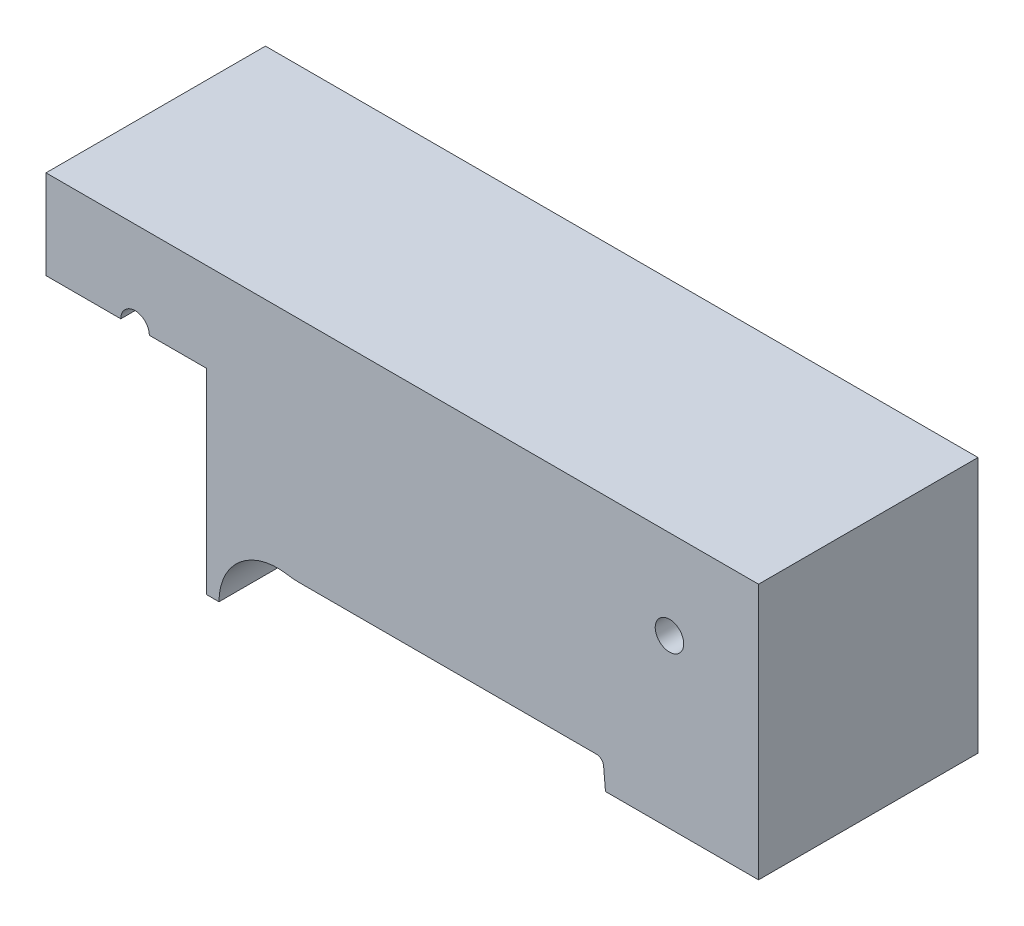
ISO-10303-21;
HEADER;
FILE_DESCRIPTION(('STEP AP214'),'2;1');
FILE_NAME('part.step','',(''),(''),'','','');
FILE_SCHEMA(('AUTOMOTIVE_DESIGN { 1 0 10303 214 1 1 1 1 }'));
ENDSEC;
DATA;
#1=APPLICATION_CONTEXT('core data for automotive mechanical design processes');
#2=APPLICATION_PROTOCOL_DEFINITION('international standard','automotive_design',2000,#1);
#3=PRODUCT_CONTEXT('',#1,'mechanical');
#4=PRODUCT('Part','Part','',(#3));
#5=PRODUCT_RELATED_PRODUCT_CATEGORY('part','',(#4));
#6=PRODUCT_DEFINITION_FORMATION('','',#4);
#7=PRODUCT_DEFINITION_CONTEXT('part definition',#1,'design');
#8=PRODUCT_DEFINITION('design','',#6,#7);
#9=PRODUCT_DEFINITION_SHAPE('','',#8);
#10=(LENGTH_UNIT() NAMED_UNIT(*) SI_UNIT(.MILLI.,.METRE.));
#11=(NAMED_UNIT(*) PLANE_ANGLE_UNIT() SI_UNIT($,.RADIAN.));
#12=(NAMED_UNIT(*) SI_UNIT($,.STERADIAN.) SOLID_ANGLE_UNIT());
#13=UNCERTAINTY_MEASURE_WITH_UNIT(LENGTH_MEASURE(1.E-05),#10,'distance_accuracy_value','');
#14=(GEOMETRIC_REPRESENTATION_CONTEXT(3) GLOBAL_UNCERTAINTY_ASSIGNED_CONTEXT((#13)) GLOBAL_UNIT_ASSIGNED_CONTEXT((#10,
#11,#12)) REPRESENTATION_CONTEXT('',''));
#15=CARTESIAN_POINT('',(0.,0.,0.));
#16=DIRECTION('',(0.,0.,1.));
#17=DIRECTION('',(1.,0.,0.));
#18=AXIS2_PLACEMENT_3D('',#15,#16,#17);
#19=CARTESIAN_POINT('',(0.,0.,65.));
#20=DIRECTION('',(1.,0.,0.));
#21=DIRECTION('',(0.,0.,-1.));
#22=AXIS2_PLACEMENT_3D('',#19,#20,#21);
#23=PLANE('',#22);
#24=DIRECTION('',(0.,1.,0.));
#25=VECTOR('',#24,1.);
#26=CARTESIAN_POINT('',(0.,0.,3.4));
#27=LINE('',#26,#25);
#28=CARTESIAN_POINT('',(0.,125.,3.4));
#29=VERTEX_POINT('',#28);
#30=CARTESIAN_POINT('',(0.,150.,3.4));
#31=VERTEX_POINT('',#30);
#32=EDGE_CURVE('E299',#29,#31,#27,.T.);
#33=ORIENTED_EDGE('',*,*,#32,.F.);
#34=DIRECTION('',(0.,0.,1.));
#35=VECTOR('',#34,1.);
#36=CARTESIAN_POINT('',(0.,125.,65.));
#37=LINE('',#36,#35);
#38=CARTESIAN_POINT('',(0.,125.,65.));
#39=VERTEX_POINT('',#38);
#40=EDGE_CURVE('E229',#29,#39,#37,.T.);
#41=ORIENTED_EDGE('',*,*,#40,.T.);
#42=DIRECTION('',(0.,-1.,0.));
#43=VECTOR('',#42,1.);
#44=CARTESIAN_POINT('',(0.,0.,65.));
#45=LINE('',#44,#43);
#46=CARTESIAN_POINT('',(0.,150.,65.));
#47=VERTEX_POINT('',#46);
#48=EDGE_CURVE('E333',#47,#39,#45,.T.);
#49=ORIENTED_EDGE('',*,*,#48,.F.);
#50=DIRECTION('',(0.,0.,-1.));
#51=VECTOR('',#50,1.);
#52=CARTESIAN_POINT('',(0.,150.,65.));
#53=LINE('',#52,#51);
#54=EDGE_CURVE('E348',#47,#31,#53,.T.);
#55=ORIENTED_EDGE('',*,*,#54,.T.);
#56=EDGE_LOOP('',(#33,#41,#49,#55));
#57=FACE_BOUND('',#56,.T.);
#58=ADVANCED_FACE('F30',(#57),#23,.F.);
#59=CARTESIAN_POINT('',(200.,0.,65.));
#60=DIRECTION('',(-1.,0.,0.));
#61=DIRECTION('',(0.,0.,1.));
#62=AXIS2_PLACEMENT_3D('',#59,#60,#61);
#63=PLANE('',#62);
#64=DIRECTION('',(0.,1.,0.));
#65=VECTOR('',#64,1.);
#66=CARTESIAN_POINT('',(200.,0.,65.));
#67=LINE('',#66,#65);
#68=CARTESIAN_POINT('',(200.,78.12,65.));
#69=VERTEX_POINT('',#68);
#70=CARTESIAN_POINT('',(200.,150.,65.));
#71=VERTEX_POINT('',#70);
#72=EDGE_CURVE('E344',#69,#71,#67,.T.);
#73=ORIENTED_EDGE('',*,*,#72,.F.);
#74=DIRECTION('',(0.,0.,-1.));
#75=VECTOR('',#74,1.);
#76=CARTESIAN_POINT('',(200.,78.12,65.));
#77=LINE('',#76,#75);
#78=CARTESIAN_POINT('',(200.,78.12,3.4));
#79=VERTEX_POINT('',#78);
#80=EDGE_CURVE('E240',#69,#79,#77,.T.);
#81=ORIENTED_EDGE('',*,*,#80,.T.);
#82=DIRECTION('',(0.,-1.,0.));
#83=VECTOR('',#82,1.);
#84=CARTESIAN_POINT('',(200.,0.,3.4));
#85=LINE('',#84,#83);
#86=CARTESIAN_POINT('',(200.,150.,3.4));
#87=VERTEX_POINT('',#86);
#88=EDGE_CURVE('E287',#87,#79,#85,.T.);
#89=ORIENTED_EDGE('',*,*,#88,.F.);
#90=DIRECTION('',(0.,0.,-1.));
#91=VECTOR('',#90,1.);
#92=CARTESIAN_POINT('',(200.,150.,65.));
#93=LINE('',#92,#91);
#94=EDGE_CURVE('E351',#71,#87,#93,.T.);
#95=ORIENTED_EDGE('',*,*,#94,.F.);
#96=EDGE_LOOP('',(#73,#81,#89,#95));
#97=FACE_BOUND('',#96,.T.);
#98=ADVANCED_FACE('F428',(#97),#63,.F.);
#99=CARTESIAN_POINT('',(0.,150.,65.));
#100=DIRECTION('',(0.,-1.,0.));
#101=DIRECTION('',(0.,0.,-1.));
#102=AXIS2_PLACEMENT_3D('',#99,#100,#101);
#103=PLANE('',#102);
#104=DIRECTION('',(1.,0.,0.));
#105=VECTOR('',#104,1.);
#106=CARTESIAN_POINT('',(0.,150.,3.4));
#107=LINE('',#106,#105);
#108=EDGE_CURVE('E354',#31,#87,#107,.T.);
#109=ORIENTED_EDGE('',*,*,#108,.F.);
#110=ORIENTED_EDGE('',*,*,#54,.F.);
#111=DIRECTION('',(-1.,0.,0.));
#112=VECTOR('',#111,1.);
#113=CARTESIAN_POINT('',(0.,150.,65.));
#114=LINE('',#113,#112);
#115=EDGE_CURVE('E346',#71,#47,#114,.T.);
#116=ORIENTED_EDGE('',*,*,#115,.F.);
#117=ORIENTED_EDGE('',*,*,#94,.T.);
#118=EDGE_LOOP('',(#109,#110,#116,#117));
#119=FACE_BOUND('',#118,.T.);
#120=ADVANCED_FACE('F433',(#119),#103,.F.);
#121=CARTESIAN_POINT('',(0.,150.,0.));
#122=DIRECTION('',(0.,0.,-1.));
#123=DIRECTION('',(-1.,0.,0.));
#124=AXIS2_PLACEMENT_3D('',#121,#122,#123);
#125=PLANE('',#124);
#126=DIRECTION('',(0.,-1.,0.));
#127=VECTOR('',#126,1.);
#128=CARTESIAN_POINT('',(45.,150.,0.));
#129=LINE('',#128,#127);
#130=CARTESIAN_POINT('',(45.,74.2424079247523,0.));
#131=VERTEX_POINT('',#130);
#132=CARTESIAN_POINT('',(45.,70.,0.));
#133=VERTEX_POINT('',#132);
#134=EDGE_CURVE('E236',#131,#133,#129,.T.);
#135=ORIENTED_EDGE('',*,*,#134,.F.);
#136=CARTESIAN_POINT('',(65.,70.,0.));
#137=DIRECTION('',(0.,0.,-1.));
#138=DIRECTION('',(-1.,0.,0.));
#139=AXIS2_PLACEMENT_3D('',#136,#137,#138);
#140=CIRCLE('',#139,20.445);
#141=CARTESIAN_POINT('',(68.4069528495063,90.1591343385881,0.));
#142=VERTEX_POINT('',#141);
#143=EDGE_CURVE('E273',#131,#142,#140,.T.);
#144=ORIENTED_EDGE('',*,*,#143,.T.);
#145=CARTESIAN_POINT('',(71.0781905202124,105.965,0.));
#146=DIRECTION('',(0.,0.,1.));
#147=DIRECTION('',(-1.,0.,0.));
#148=AXIS2_PLACEMENT_3D('',#145,#146,#147);
#149=CIRCLE('',#148,16.03);
#150=CARTESIAN_POINT('',(71.0781905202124,89.935,0.));
#151=VERTEX_POINT('',#150);
#152=EDGE_CURVE('E275',#142,#151,#149,.T.);
#153=ORIENTED_EDGE('',*,*,#152,.T.);
#154=DIRECTION('',(1.,0.,0.));
#155=VECTOR('',#154,1.);
#156=CARTESIAN_POINT('',(71.0781905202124,89.935,0.));
#157=LINE('',#156,#155);
#158=CARTESIAN_POINT('',(154.489847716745,89.935,0.));
#159=VERTEX_POINT('',#158);
#160=EDGE_CURVE('E278',#151,#159,#157,.T.);
#161=ORIENTED_EDGE('',*,*,#160,.T.);
#162=CARTESIAN_POINT('',(154.489847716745,83.905,0.));
#163=DIRECTION('',(0.,0.,-1.));
#164=DIRECTION('',(-1.,0.,0.));
#165=AXIS2_PLACEMENT_3D('',#162,#163,#164);
#166=CIRCLE('',#165,6.03);
#167=CARTESIAN_POINT('',(160.496901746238,84.4305491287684,0.));
#168=VERTEX_POINT('',#167);
#169=EDGE_CURVE('E281',#159,#168,#166,.T.);
#170=ORIENTED_EDGE('',*,*,#169,.T.);
#171=DIRECTION('',(0.0871557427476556,-0.996194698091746,0.));
#172=VECTOR('',#171,1.);
#173=CARTESIAN_POINT('',(160.496901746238,84.4305491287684,0.));
#174=LINE('',#173,#172);
#175=CARTESIAN_POINT('',(161.049003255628,78.12,0.));
#176=VERTEX_POINT('',#175);
#177=EDGE_CURVE('E270',#168,#176,#174,.T.);
#178=ORIENTED_EDGE('',*,*,#177,.T.);
#179=DIRECTION('',(1.,0.,0.));
#180=VECTOR('',#179,1.);
#181=CARTESIAN_POINT('',(0.,78.12,0.));
#182=LINE('',#181,#180);
#183=CARTESIAN_POINT('',(157.033723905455,78.12,0.));
#184=VERTEX_POINT('',#183);
#185=EDGE_CURVE('E243',#184,#176,#182,.T.);
#186=ORIENTED_EDGE('',*,*,#185,.F.);
#187=DIRECTION('',(-0.0871557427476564,0.996194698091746,0.));
#188=VECTOR('',#187,1.);
#189=CARTESIAN_POINT('',(156.512122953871,84.0819261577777,0.));
#190=LINE('',#189,#188);
#191=CARTESIAN_POINT('',(156.512122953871,84.0819261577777,0.));
#192=VERTEX_POINT('',#191);
#193=EDGE_CURVE('E321',#184,#192,#190,.T.);
#194=ORIENTED_EDGE('',*,*,#193,.T.);
#195=CARTESIAN_POINT('',(154.489847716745,83.905,0.));
#196=DIRECTION('',(0.,0.,1.));
#197=DIRECTION('',(-1.,0.,0.));
#198=AXIS2_PLACEMENT_3D('',#195,#196,#197);
#199=CIRCLE('',#198,2.03);
#200=CARTESIAN_POINT('',(154.489847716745,85.935,0.));
#201=VERTEX_POINT('',#200);
#202=EDGE_CURVE('E324',#192,#201,#199,.T.);
#203=ORIENTED_EDGE('',*,*,#202,.T.);
#204=DIRECTION('',(-1.,0.,0.));
#205=VECTOR('',#204,1.);
#206=CARTESIAN_POINT('',(71.0781905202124,85.935,0.));
#207=LINE('',#206,#205);
#208=CARTESIAN_POINT('',(71.0781905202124,85.935,0.));
#209=VERTEX_POINT('',#208);
#210=EDGE_CURVE('E327',#201,#209,#207,.T.);
#211=ORIENTED_EDGE('',*,*,#210,.T.);
#212=CARTESIAN_POINT('',(71.0781905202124,105.965,0.));
#213=DIRECTION('',(0.,0.,-1.));
#214=DIRECTION('',(-1.,0.,0.));
#215=AXIS2_PLACEMENT_3D('',#212,#213,#214);
#216=CIRCLE('',#215,20.03);
#217=CARTESIAN_POINT('',(67.7403932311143,86.2150630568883,0.));
#218=VERTEX_POINT('',#217);
#219=EDGE_CURVE('E315',#209,#218,#216,.T.);
#220=ORIENTED_EDGE('',*,*,#219,.T.);
#221=CARTESIAN_POINT('',(65.,70.,0.));
#222=DIRECTION('',(0.,0.,1.));
#223=DIRECTION('',(1.,0.,0.));
#224=AXIS2_PLACEMENT_3D('',#221,#222,#223);
#225=CIRCLE('',#224,16.445);
#226=CARTESIAN_POINT('',(48.555,70.,0.));
#227=VERTEX_POINT('',#226);
#228=EDGE_CURVE('E318',#218,#227,#225,.T.);
#229=ORIENTED_EDGE('',*,*,#228,.T.);
#230=DIRECTION('',(1.,0.,0.));
#231=VECTOR('',#230,1.);
#232=CARTESIAN_POINT('',(0.,70.,0.));
#233=LINE('',#232,#231);
#234=EDGE_CURVE('E245',#133,#227,#233,.T.);
#235=ORIENTED_EDGE('',*,*,#234,.F.);
#236=EDGE_LOOP('',(#135,#144,#153,#161,#170,#178,#186,#194,#203,#211,#220,#229,#235));
#237=FACE_BOUND('',#236,.T.);
#238=ADVANCED_FACE('F474',(#237),#125,.T.);
#239=CARTESIAN_POINT('',(0.,150.,65.));
#240=DIRECTION('',(0.,0.,-1.));
#241=DIRECTION('',(-1.,0.,0.));
#242=AXIS2_PLACEMENT_3D('',#239,#240,#241);
#243=PLANE('',#242);
#244=ORIENTED_EDGE('',*,*,#48,.T.);
#245=DIRECTION('',(1.,0.,0.));
#246=VECTOR('',#245,1.);
#247=CARTESIAN_POINT('',(-8.28625235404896,125.,65.));
#248=LINE('',#247,#246);
#249=CARTESIAN_POINT('',(21.,125.,65.));
#250=VERTEX_POINT('',#249);
#251=EDGE_CURVE('E216',#39,#250,#248,.T.);
#252=ORIENTED_EDGE('',*,*,#251,.T.);
#253=CARTESIAN_POINT('',(25.,125.,65.));
#254=DIRECTION('',(0.,0.,1.));
#255=DIRECTION('',(1.,0.,0.));
#256=AXIS2_PLACEMENT_3D('',#253,#254,#255);
#257=CIRCLE('',#256,3.99999999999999);
#258=CARTESIAN_POINT('',(29.,125.,65.));
#259=VERTEX_POINT('',#258);
#260=EDGE_CURVE('E215',#259,#250,#257,.T.);
#261=ORIENTED_EDGE('',*,*,#260,.F.);
#262=CARTESIAN_POINT('',(45.,125.,65.));
#263=VERTEX_POINT('',#262);
#264=EDGE_CURVE('E202',#259,#263,#248,.T.);
#265=ORIENTED_EDGE('',*,*,#264,.T.);
#266=DIRECTION('',(0.,-1.,0.));
#267=VECTOR('',#266,1.);
#268=CARTESIAN_POINT('',(45.,125.,65.));
#269=LINE('',#268,#267);
#270=CARTESIAN_POINT('',(45.,70.,65.));
#271=VERTEX_POINT('',#270);
#272=EDGE_CURVE('E192',#263,#271,#269,.T.);
#273=ORIENTED_EDGE('',*,*,#272,.T.);
#274=DIRECTION('',(1.,0.,0.));
#275=VECTOR('',#274,1.);
#276=CARTESIAN_POINT('',(45.,70.,65.));
#277=LINE('',#276,#275);
#278=CARTESIAN_POINT('',(48.555,70.,65.));
#279=VERTEX_POINT('',#278);
#280=EDGE_CURVE('E207',#271,#279,#277,.T.);
#281=ORIENTED_EDGE('',*,*,#280,.T.);
#282=CARTESIAN_POINT('',(65.,70.,65.));
#283=DIRECTION('',(0.,0.,1.));
#284=DIRECTION('',(1.,0.,0.));
#285=AXIS2_PLACEMENT_3D('',#282,#283,#284);
#286=CIRCLE('',#285,16.445);
#287=CARTESIAN_POINT('',(67.7403932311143,86.2150630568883,65.));
#288=VERTEX_POINT('',#287);
#289=EDGE_CURVE('E303',#288,#279,#286,.T.);
#290=ORIENTED_EDGE('',*,*,#289,.F.);
#291=CARTESIAN_POINT('',(71.0781905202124,105.965,65.));
#292=DIRECTION('',(0.,0.,-1.));
#293=DIRECTION('',(-1.,0.,0.));
#294=AXIS2_PLACEMENT_3D('',#291,#292,#293);
#295=CIRCLE('',#294,20.03);
#296=CARTESIAN_POINT('',(71.0781905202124,85.935,65.));
#297=VERTEX_POINT('',#296);
#298=EDGE_CURVE('E301',#297,#288,#295,.T.);
#299=ORIENTED_EDGE('',*,*,#298,.F.);
#300=DIRECTION('',(-1.,0.,0.));
#301=VECTOR('',#300,1.);
#302=CARTESIAN_POINT('',(71.0781905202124,85.935,65.));
#303=LINE('',#302,#301);
#304=CARTESIAN_POINT('',(154.489847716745,85.935,65.));
#305=VERTEX_POINT('',#304);
#306=EDGE_CURVE('E312',#305,#297,#303,.T.);
#307=ORIENTED_EDGE('',*,*,#306,.F.);
#308=CARTESIAN_POINT('',(154.489847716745,83.905,65.));
#309=DIRECTION('',(0.,0.,1.));
#310=DIRECTION('',(-1.,0.,0.));
#311=AXIS2_PLACEMENT_3D('',#308,#309,#310);
#312=CIRCLE('',#311,2.03);
#313=CARTESIAN_POINT('',(156.512122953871,84.0819261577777,65.));
#314=VERTEX_POINT('',#313);
#315=EDGE_CURVE('E309',#314,#305,#312,.T.);
#316=ORIENTED_EDGE('',*,*,#315,.F.);
#317=DIRECTION('',(-0.0871557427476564,0.996194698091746,0.));
#318=VECTOR('',#317,1.);
#319=CARTESIAN_POINT('',(156.512122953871,84.0819261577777,65.));
#320=LINE('',#319,#318);
#321=CARTESIAN_POINT('',(157.033723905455,78.12,65.));
#322=VERTEX_POINT('',#321);
#323=EDGE_CURVE('E306',#322,#314,#320,.T.);
#324=ORIENTED_EDGE('',*,*,#323,.F.);
#325=DIRECTION('',(1.,0.,0.));
#326=VECTOR('',#325,1.);
#327=CARTESIAN_POINT('',(82.4133961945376,78.12,65.));
#328=LINE('',#327,#326);
#329=EDGE_CURVE('E220',#322,#69,#328,.T.);
#330=ORIENTED_EDGE('',*,*,#329,.T.);
#331=ORIENTED_EDGE('',*,*,#72,.T.);
#332=ORIENTED_EDGE('',*,*,#115,.T.);
#333=EDGE_LOOP('',(#244,#252,#261,#265,#273,#281,#290,#299,#307,#316,#324,#330,#331,#332));
#334=FACE_BOUND('',#333,.T.);
#335=CARTESIAN_POINT('',(175.,125.,65.));
#336=DIRECTION('',(0.,0.,1.));
#337=DIRECTION('',(1.,0.,0.));
#338=AXIS2_PLACEMENT_3D('',#335,#336,#337);
#339=CIRCLE('',#338,3.99999999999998);
#340=CARTESIAN_POINT('',(179.,125.,65.));
#341=VERTEX_POINT('',#340);
#342=EDGE_CURVE('E254',#341,#341,#339,.T.);
#343=ORIENTED_EDGE('',*,*,#342,.F.);
#344=EDGE_LOOP('',(#343));
#345=FACE_BOUND('',#344,.T.);
#346=ADVANCED_FACE('F211',(#334,#345),#243,.F.);
#347=CARTESIAN_POINT('',(71.0781905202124,105.965,0.));
#348=DIRECTION('',(0.,0.,1.));
#349=DIRECTION('',(1.,0.,0.));
#350=AXIS2_PLACEMENT_3D('',#347,#348,#349);
#351=CYLINDRICAL_SURFACE('',#350,20.03);
#352=ORIENTED_EDGE('',*,*,#298,.T.);
#353=DIRECTION('',(0.,0.,1.));
#354=VECTOR('',#353,1.);
#355=CARTESIAN_POINT('',(67.7403932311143,86.2150630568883,0.));
#356=LINE('',#355,#354);
#357=EDGE_CURVE('E330',#218,#288,#356,.T.);
#358=ORIENTED_EDGE('',*,*,#357,.F.);
#359=ORIENTED_EDGE('',*,*,#219,.F.);
#360=DIRECTION('',(0.,0.,1.));
#361=VECTOR('',#360,1.);
#362=CARTESIAN_POINT('',(71.0781905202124,85.935,0.));
#363=LINE('',#362,#361);
#364=EDGE_CURVE('E331',#209,#297,#363,.T.);
#365=ORIENTED_EDGE('',*,*,#364,.T.);
#366=EDGE_LOOP('',(#352,#358,#359,#365));
#367=FACE_BOUND('',#366,.T.);
#368=ADVANCED_FACE('F491',(#367),#351,.T.);
#369=CARTESIAN_POINT('',(71.0781905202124,85.935,0.));
#370=DIRECTION('',(0.,1.,0.));
#371=DIRECTION('',(-1.,0.,0.));
#372=AXIS2_PLACEMENT_3D('',#369,#370,#371);
#373=PLANE('',#372);
#374=ORIENTED_EDGE('',*,*,#306,.T.);
#375=ORIENTED_EDGE('',*,*,#364,.F.);
#376=ORIENTED_EDGE('',*,*,#210,.F.);
#377=DIRECTION('',(0.,0.,1.));
#378=VECTOR('',#377,1.);
#379=CARTESIAN_POINT('',(154.489847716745,85.935,0.));
#380=LINE('',#379,#378);
#381=EDGE_CURVE('E334',#201,#305,#380,.T.);
#382=ORIENTED_EDGE('',*,*,#381,.T.);
#383=EDGE_LOOP('',(#374,#375,#376,#382));
#384=FACE_BOUND('',#383,.T.);
#385=ADVANCED_FACE('F494',(#384),#373,.F.);
#386=CARTESIAN_POINT('',(154.489847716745,83.905,0.));
#387=DIRECTION('',(0.,0.,1.));
#388=DIRECTION('',(1.,0.,0.));
#389=AXIS2_PLACEMENT_3D('',#386,#387,#388);
#390=CYLINDRICAL_SURFACE('',#389,2.03);
#391=ORIENTED_EDGE('',*,*,#315,.T.);
#392=ORIENTED_EDGE('',*,*,#381,.F.);
#393=ORIENTED_EDGE('',*,*,#202,.F.);
#394=DIRECTION('',(0.,0.,1.));
#395=VECTOR('',#394,1.);
#396=CARTESIAN_POINT('',(156.512122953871,84.0819261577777,0.));
#397=LINE('',#396,#395);
#398=EDGE_CURVE('E336',#192,#314,#397,.T.);
#399=ORIENTED_EDGE('',*,*,#398,.T.);
#400=EDGE_LOOP('',(#391,#392,#393,#399));
#401=FACE_BOUND('',#400,.T.);
#402=ADVANCED_FACE('F497',(#401),#390,.F.);
#403=CARTESIAN_POINT('',(156.512122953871,84.0819261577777,0.));
#404=DIRECTION('',(0.996194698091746,0.0871557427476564,0.));
#405=DIRECTION('',(-0.0871557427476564,0.996194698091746,0.));
#406=AXIS2_PLACEMENT_3D('',#403,#404,#405);
#407=PLANE('',#406);
#408=ORIENTED_EDGE('',*,*,#323,.T.);
#409=ORIENTED_EDGE('',*,*,#398,.F.);
#410=ORIENTED_EDGE('',*,*,#193,.F.);
#411=DIRECTION('',(0.,0.,1.));
#412=VECTOR('',#411,1.);
#413=CARTESIAN_POINT('',(157.033723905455,78.12,0.));
#414=LINE('',#413,#412);
#415=EDGE_CURVE('E338',#184,#322,#414,.T.);
#416=ORIENTED_EDGE('',*,*,#415,.T.);
#417=EDGE_LOOP('',(#408,#409,#410,#416));
#418=FACE_BOUND('',#417,.T.);
#419=ADVANCED_FACE('F500',(#418),#407,.F.);
#420=CARTESIAN_POINT('',(65.,70.,0.));
#421=DIRECTION('',(0.,0.,1.));
#422=DIRECTION('',(1.,0.,0.));
#423=AXIS2_PLACEMENT_3D('',#420,#421,#422);
#424=CYLINDRICAL_SURFACE('',#423,16.445);
#425=ORIENTED_EDGE('',*,*,#289,.T.);
#426=DIRECTION('',(0.,0.,1.));
#427=VECTOR('',#426,1.);
#428=CARTESIAN_POINT('',(48.555,70.,0.));
#429=LINE('',#428,#427);
#430=EDGE_CURVE('E11',#279,#227,#429,.F.);
#431=ORIENTED_EDGE('',*,*,#430,.T.);
#432=ORIENTED_EDGE('',*,*,#228,.F.);
#433=ORIENTED_EDGE('',*,*,#357,.T.);
#434=EDGE_LOOP('',(#425,#431,#432,#433));
#435=FACE_BOUND('',#434,.T.);
#436=ADVANCED_FACE('F485',(#435),#424,.F.);
#437=CARTESIAN_POINT('',(210.705320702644,-13.0537997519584,3.4));
#438=DIRECTION('',(0.,0.,-1.));
#439=DIRECTION('',(-1.,0.,0.));
#440=AXIS2_PLACEMENT_3D('',#437,#438,#439);
#441=PLANE('',#440);
#442=DIRECTION('',(1.,0.,0.));
#443=VECTOR('',#442,1.);
#444=CARTESIAN_POINT('',(210.705320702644,125.,3.4));
#445=LINE('',#444,#443);
#446=CARTESIAN_POINT('',(45.,125.,3.4));
#447=VERTEX_POINT('',#446);
#448=EDGE_CURVE('E206',#29,#447,#445,.T.);
#449=ORIENTED_EDGE('',*,*,#448,.F.);
#450=ORIENTED_EDGE('',*,*,#32,.T.);
#451=ORIENTED_EDGE('',*,*,#108,.T.);
#452=ORIENTED_EDGE('',*,*,#88,.T.);
#453=DIRECTION('',(1.,0.,0.));
#454=VECTOR('',#453,1.);
#455=CARTESIAN_POINT('',(210.705320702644,78.12,3.4));
#456=LINE('',#455,#454);
#457=CARTESIAN_POINT('',(164.060462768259,78.12,3.4));
#458=VERTEX_POINT('',#457);
#459=EDGE_CURVE('E238',#458,#79,#456,.T.);
#460=ORIENTED_EDGE('',*,*,#459,.F.);
#461=DIRECTION('',(0.0871557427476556,-0.996194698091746,0.));
#462=VECTOR('',#461,1.);
#463=CARTESIAN_POINT('',(163.485485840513,84.6920163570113,3.4));
#464=LINE('',#463,#462);
#465=CARTESIAN_POINT('',(163.485485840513,84.6920163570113,3.4));
#466=VERTEX_POINT('',#465);
#467=EDGE_CURVE('E359',#458,#466,#464,.F.);
#468=ORIENTED_EDGE('',*,*,#467,.T.);
#469=CARTESIAN_POINT('',(154.489847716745,83.905,3.4));
#470=DIRECTION('',(0.,0.,-1.));
#471=DIRECTION('',(-1.,0.,0.));
#472=AXIS2_PLACEMENT_3D('',#469,#470,#471);
#473=CIRCLE('',#472,9.03);
#474=CARTESIAN_POINT('',(154.489847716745,92.935,3.4));
#475=VERTEX_POINT('',#474);
#476=EDGE_CURVE('E361',#466,#475,#473,.F.);
#477=ORIENTED_EDGE('',*,*,#476,.T.);
#478=DIRECTION('',(1.,0.,0.));
#479=VECTOR('',#478,1.);
#480=CARTESIAN_POINT('',(71.0781905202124,92.935,3.4));
#481=LINE('',#480,#479);
#482=CARTESIAN_POINT('',(71.0781905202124,92.935,3.4));
#483=VERTEX_POINT('',#482);
#484=EDGE_CURVE('E363',#475,#483,#481,.F.);
#485=ORIENTED_EDGE('',*,*,#484,.T.);
#486=CARTESIAN_POINT('',(71.0781905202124,105.965,3.4));
#487=DIRECTION('',(0.,0.,-1.));
#488=DIRECTION('',(-1.,0.,0.));
#489=AXIS2_PLACEMENT_3D('',#486,#487,#488);
#490=CIRCLE('',#489,13.03);
#491=CARTESIAN_POINT('',(68.9068725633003,93.1171877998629,3.4));
#492=VERTEX_POINT('',#491);
#493=EDGE_CURVE('E368',#483,#492,#490,.T.);
#494=ORIENTED_EDGE('',*,*,#493,.T.);
#495=CARTESIAN_POINT('',(65.,70.,3.4));
#496=DIRECTION('',(0.,0.,-1.));
#497=DIRECTION('',(-1.,0.,0.));
#498=AXIS2_PLACEMENT_3D('',#495,#496,#497);
#499=CIRCLE('',#498,23.445);
#500=CARTESIAN_POINT('',(45.,82.2338883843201,3.4));
#501=VERTEX_POINT('',#500);
#502=EDGE_CURVE('E365',#492,#501,#499,.F.);
#503=ORIENTED_EDGE('',*,*,#502,.T.);
#504=DIRECTION('',(0.,-1.,0.));
#505=VECTOR('',#504,1.);
#506=CARTESIAN_POINT('',(45.,-13.0537997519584,3.4));
#507=LINE('',#506,#505);
#508=EDGE_CURVE('E234',#447,#501,#507,.T.);
#509=ORIENTED_EDGE('',*,*,#508,.F.);
#510=EDGE_LOOP('',(#449,#450,#451,#452,#460,#468,#477,#485,#494,#503,#509));
#511=FACE_BOUND('',#510,.T.);
#512=ADVANCED_FACE('F440',(#511),#441,.T.);
#513=CARTESIAN_POINT('',(160.496901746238,84.4305491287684,3.4));
#514=DIRECTION('',(0.996194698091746,0.0871557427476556,0.));
#515=DIRECTION('',(-0.0871557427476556,0.996194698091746,0.));
#516=AXIS2_PLACEMENT_3D('',#513,#514,#515);
#517=PLANE('',#516);
#518=DIRECTION('',(0.,0.,-1.));
#519=VECTOR('',#518,1.);
#520=CARTESIAN_POINT('',(160.496901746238,84.4305491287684,3.4));
#521=LINE('',#520,#519);
#522=CARTESIAN_POINT('',(160.496901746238,84.4305491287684,0.4));
#523=VERTEX_POINT('',#522);
#524=EDGE_CURVE('E285',#523,#168,#521,.T.);
#525=ORIENTED_EDGE('',*,*,#524,.F.);
#526=DIRECTION('',(0.0871557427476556,-0.996194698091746,0.));
#527=VECTOR('',#526,1.);
#528=CARTESIAN_POINT('',(161.049003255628,78.12,0.4));
#529=LINE('',#528,#527);
#530=CARTESIAN_POINT('',(161.049003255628,78.12,0.4));
#531=VERTEX_POINT('',#530);
#532=EDGE_CURVE('E376',#523,#531,#529,.T.);
#533=ORIENTED_EDGE('',*,*,#532,.T.);
#534=DIRECTION('',(0.,0.,-1.));
#535=VECTOR('',#534,1.);
#536=CARTESIAN_POINT('',(161.049003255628,78.12,3.4));
#537=LINE('',#536,#535);
#538=EDGE_CURVE('E284',#531,#176,#537,.T.);
#539=ORIENTED_EDGE('',*,*,#538,.T.);
#540=ORIENTED_EDGE('',*,*,#177,.F.);
#541=EDGE_LOOP('',(#525,#533,#539,#540));
#542=FACE_BOUND('',#541,.T.);
#543=ADVANCED_FACE('F506',(#542),#517,.T.);
#544=CARTESIAN_POINT('',(154.489847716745,83.905,3.4));
#545=DIRECTION('',(0.,0.,-1.));
#546=DIRECTION('',(-1.,0.,0.));
#547=AXIS2_PLACEMENT_3D('',#544,#545,#546);
#548=CYLINDRICAL_SURFACE('',#547,6.03);
#549=DIRECTION('',(0.,0.,-1.));
#550=VECTOR('',#549,1.);
#551=CARTESIAN_POINT('',(154.489847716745,89.935,3.4));
#552=LINE('',#551,#550);
#553=CARTESIAN_POINT('',(154.489847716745,89.935,0.4));
#554=VERTEX_POINT('',#553);
#555=EDGE_CURVE('E288',#554,#159,#552,.T.);
#556=ORIENTED_EDGE('',*,*,#555,.F.);
#557=CARTESIAN_POINT('',(154.489847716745,83.905,0.4));
#558=DIRECTION('',(0.,0.,-1.));
#559=DIRECTION('',(-1.,0.,0.));
#560=AXIS2_PLACEMENT_3D('',#557,#558,#559);
#561=CIRCLE('',#560,6.03);
#562=EDGE_CURVE('E52',#554,#523,#561,.T.);
#563=ORIENTED_EDGE('',*,*,#562,.T.);
#564=ORIENTED_EDGE('',*,*,#524,.T.);
#565=ORIENTED_EDGE('',*,*,#169,.F.);
#566=EDGE_LOOP('',(#556,#563,#564,#565));
#567=FACE_BOUND('',#566,.T.);
#568=ADVANCED_FACE('F507',(#567),#548,.T.);
#569=CARTESIAN_POINT('',(71.0781905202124,89.935,3.4));
#570=DIRECTION('',(0.,1.,0.));
#571=DIRECTION('',(-1.,0.,0.));
#572=AXIS2_PLACEMENT_3D('',#569,#570,#571);
#573=PLANE('',#572);
#574=DIRECTION('',(0.,0.,-1.));
#575=VECTOR('',#574,1.);
#576=CARTESIAN_POINT('',(71.0781905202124,89.935,3.4));
#577=LINE('',#576,#575);
#578=CARTESIAN_POINT('',(71.0781905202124,89.935,0.4));
#579=VERTEX_POINT('',#578);
#580=EDGE_CURVE('E290',#579,#151,#577,.T.);
#581=ORIENTED_EDGE('',*,*,#580,.F.);
#582=DIRECTION('',(1.,0.,0.));
#583=VECTOR('',#582,1.);
#584=CARTESIAN_POINT('',(154.489847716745,89.935,0.4));
#585=LINE('',#584,#583);
#586=EDGE_CURVE('E373',#579,#554,#585,.T.);
#587=ORIENTED_EDGE('',*,*,#586,.T.);
#588=ORIENTED_EDGE('',*,*,#555,.T.);
#589=ORIENTED_EDGE('',*,*,#160,.F.);
#590=EDGE_LOOP('',(#581,#587,#588,#589));
#591=FACE_BOUND('',#590,.T.);
#592=ADVANCED_FACE('F470',(#591),#573,.T.);
#593=CARTESIAN_POINT('',(71.0781905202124,105.965,3.4));
#594=DIRECTION('',(0.,0.,-1.));
#595=DIRECTION('',(-1.,0.,0.));
#596=AXIS2_PLACEMENT_3D('',#593,#594,#595);
#597=CYLINDRICAL_SURFACE('',#596,16.03);
#598=DIRECTION('',(0.,0.,-1.));
#599=VECTOR('',#598,1.);
#600=CARTESIAN_POINT('',(68.4069528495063,90.1591343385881,3.4));
#601=LINE('',#600,#599);
#602=CARTESIAN_POINT('',(68.4069528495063,90.1591343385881,0.4));
#603=VERTEX_POINT('',#602);
#604=EDGE_CURVE('E292',#603,#142,#601,.T.);
#605=ORIENTED_EDGE('',*,*,#604,.F.);
#606=CARTESIAN_POINT('',(71.0781905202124,105.965,0.4));
#607=DIRECTION('',(0.,0.,-1.));
#608=DIRECTION('',(-1.,0.,0.));
#609=AXIS2_PLACEMENT_3D('',#606,#607,#608);
#610=CIRCLE('',#609,16.03);
#611=EDGE_CURVE('E356',#603,#579,#610,.F.);
#612=ORIENTED_EDGE('',*,*,#611,.T.);
#613=ORIENTED_EDGE('',*,*,#580,.T.);
#614=ORIENTED_EDGE('',*,*,#152,.F.);
#615=EDGE_LOOP('',(#605,#612,#613,#614));
#616=FACE_BOUND('',#615,.T.);
#617=ADVANCED_FACE('F467',(#616),#597,.F.);
#618=CARTESIAN_POINT('',(65.,70.,3.4));
#619=DIRECTION('',(0.,0.,-1.));
#620=DIRECTION('',(-1.,0.,0.));
#621=AXIS2_PLACEMENT_3D('',#618,#619,#620);
#622=CYLINDRICAL_SURFACE('',#621,20.445);
#623=DIRECTION('',(0.,0.,-1.));
#624=VECTOR('',#623,1.);
#625=CARTESIAN_POINT('',(45.,74.2424079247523,3.4));
#626=LINE('',#625,#624);
#627=CARTESIAN_POINT('',(45.,74.2424079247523,0.400000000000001));
#628=VERTEX_POINT('',#627);
#629=EDGE_CURVE('E232',#628,#131,#626,.T.);
#630=ORIENTED_EDGE('',*,*,#629,.F.);
#631=CARTESIAN_POINT('',(65.,70.,0.4));
#632=DIRECTION('',(0.,0.,-1.));
#633=DIRECTION('',(-1.,0.,0.));
#634=AXIS2_PLACEMENT_3D('',#631,#632,#633);
#635=CIRCLE('',#634,20.445);
#636=EDGE_CURVE('E371',#628,#603,#635,.T.);
#637=ORIENTED_EDGE('',*,*,#636,.T.);
#638=ORIENTED_EDGE('',*,*,#604,.T.);
#639=ORIENTED_EDGE('',*,*,#143,.F.);
#640=EDGE_LOOP('',(#630,#637,#638,#639));
#641=FACE_BOUND('',#640,.T.);
#642=ADVANCED_FACE('F479',(#641),#622,.T.);
#643=CARTESIAN_POINT('',(163.485485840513,84.6920163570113,0.4));
#644=DIRECTION('',(-0.0871557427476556,0.996194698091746,0.));
#645=DIRECTION('',(-0.996194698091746,-0.0871557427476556,0.));
#646=AXIS2_PLACEMENT_3D('',#643,#644,#645);
#647=CYLINDRICAL_SURFACE('',#646,3.);
#648=CARTESIAN_POINT('',(164.060462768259,78.12,0.4));
#649=DIRECTION('',(0.,1.,0.));
#650=DIRECTION('',(-1.,0.,0.));
#651=AXIS2_PLACEMENT_3D('',#648,#649,#650);
#652=ELLIPSE('',#651,3.01145951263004,3.);
#653=EDGE_CURVE('E267',#458,#531,#652,.F.);
#654=ORIENTED_EDGE('',*,*,#653,.T.);
#655=ORIENTED_EDGE('',*,*,#532,.F.);
#656=CARTESIAN_POINT('',(163.485485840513,84.6920163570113,0.4));
#657=DIRECTION('',(0.0871557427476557,-0.996194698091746,0.));
#658=DIRECTION('',(0.996194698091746,0.0871557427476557,0.));
#659=AXIS2_PLACEMENT_3D('',#656,#657,#658);
#660=CIRCLE('',#659,3.);
#661=EDGE_CURVE('E264',#466,#523,#660,.T.);
#662=ORIENTED_EDGE('',*,*,#661,.F.);
#663=ORIENTED_EDGE('',*,*,#467,.F.);
#664=EDGE_LOOP('',(#654,#655,#662,#663));
#665=FACE_BOUND('',#664,.T.);
#666=ADVANCED_FACE('F451',(#665),#647,.F.);
#667=CARTESIAN_POINT('',(154.489847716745,83.905,0.4));
#668=DIRECTION('',(0.,0.,-1.));
#669=DIRECTION('',(-1.,0.,0.));
#670=AXIS2_PLACEMENT_3D('',#667,#668,#669);
#671=TOROIDAL_SURFACE('',#670,9.03,3.);
#672=ORIENTED_EDGE('',*,*,#661,.T.);
#673=ORIENTED_EDGE('',*,*,#562,.F.);
#674=CARTESIAN_POINT('',(154.489847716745,92.935,0.4));
#675=DIRECTION('',(1.,0.,0.));
#676=DIRECTION('',(0.,0.,-1.));
#677=AXIS2_PLACEMENT_3D('',#674,#675,#676);
#678=CIRCLE('',#677,3.);
#679=EDGE_CURVE('E261',#475,#554,#678,.T.);
#680=ORIENTED_EDGE('',*,*,#679,.F.);
#681=ORIENTED_EDGE('',*,*,#476,.F.);
#682=EDGE_LOOP('',(#672,#673,#680,#681));
#683=FACE_BOUND('',#682,.T.);
#684=ADVANCED_FACE('F425',(#683),#671,.F.);
#685=CARTESIAN_POINT('',(65.,70.,0.4));
#686=DIRECTION('',(0.,0.,-1.));
#687=DIRECTION('',(-1.,0.,0.));
#688=AXIS2_PLACEMENT_3D('',#685,#686,#687);
#689=TOROIDAL_SURFACE('',#688,23.445,3.);
#690=ORIENTED_EDGE('',*,*,#636,.F.);
#691=CARTESIAN_POINT('',(45.,74.2424119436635,0.397763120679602));
#692=CARTESIAN_POINT('',(45.,74.2422846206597,0.436382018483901));
#693=CARTESIAN_POINT('',(45.,74.2457837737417,0.475064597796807));
#694=CARTESIAN_POINT('',(45.,74.2595823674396,0.551236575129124));
#695=CARTESIAN_POINT('',(45.,74.2699016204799,0.588722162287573));
#696=CARTESIAN_POINT('',(45.,74.3006091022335,0.67414926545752));
#697=CARTESIAN_POINT('',(45.,74.323235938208,0.721272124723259));
#698=CARTESIAN_POINT('',(45.,74.3754293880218,0.811456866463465));
#699=CARTESIAN_POINT('',(45.,74.4050124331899,0.854508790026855));
#700=CARTESIAN_POINT('',(45.,74.4752516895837,0.945304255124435));
#701=CARTESIAN_POINT('',(45.,74.5169374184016,0.99223657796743));
#702=CARTESIAN_POINT('',(45.,74.6046187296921,1.08193936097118));
#703=CARTESIAN_POINT('',(45.,74.6506221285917,1.12470197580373));
#704=CARTESIAN_POINT('',(45.,74.7457595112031,1.20710476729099));
#705=CARTESIAN_POINT('',(45.,74.7949093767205,1.24672640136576));
#706=CARTESIAN_POINT('',(45.,74.8952181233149,1.32321714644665));
#707=CARTESIAN_POINT('',(45.,74.9463752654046,1.36008856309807));
#708=CARTESIAN_POINT('',(45.,75.0912359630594,1.45991072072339));
#709=CARTESIAN_POINT('',(45.,75.1866054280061,1.52043705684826));
#710=CARTESIAN_POINT('',(45.,75.3804487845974,1.63633549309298));
#711=CARTESIAN_POINT('',(45.,75.4789245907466,1.69170432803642));
#712=CARTESIAN_POINT('',(45.,75.6782482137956,1.79847034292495));
#713=CARTESIAN_POINT('',(45.,75.7791003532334,1.84985941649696));
#714=CARTESIAN_POINT('',(45.,75.9824630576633,1.94925655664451));
#715=CARTESIAN_POINT('',(45.,76.0849738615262,1.99726413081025));
#716=CARTESIAN_POINT('',(45.,76.3951042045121,2.13723135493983));
#717=CARTESIAN_POINT('',(45.,76.6047042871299,2.22481399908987));
#718=CARTESIAN_POINT('',(45.,77.0273683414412,2.39028368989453));
#719=CARTESIAN_POINT('',(45.,77.2404279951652,2.46818190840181));
#720=CARTESIAN_POINT('',(45.,77.6706159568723,2.61556277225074));
#721=CARTESIAN_POINT('',(45.,77.8877591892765,2.68500182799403));
#722=CARTESIAN_POINT('',(45.,78.3246535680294,2.81521115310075));
#723=CARTESIAN_POINT('',(45.,78.5444050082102,2.87598043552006));
#724=CARTESIAN_POINT('',(45.,78.9864944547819,2.98870336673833));
#725=CARTESIAN_POINT('',(45.,79.2088356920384,3.04064437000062));
#726=CARTESIAN_POINT('',(45.,79.6555105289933,3.13509319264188));
#727=CARTESIAN_POINT('',(45.,79.8798440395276,3.1776014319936));
#728=CARTESIAN_POINT('',(45.,80.3291117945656,3.25224700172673));
#729=CARTESIAN_POINT('',(45.,80.554037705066,3.28443414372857));
#730=CARTESIAN_POINT('',(45.,81.0052163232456,3.33774328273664));
#731=CARTESIAN_POINT('',(45.,81.2314690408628,3.35886519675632));
#732=CARTESIAN_POINT('',(45.,81.6843765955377,3.38879240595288));
#733=CARTESIAN_POINT('',(45.,81.9110298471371,3.3976210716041));
#734=CARTESIAN_POINT('',(45.,82.3645054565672,3.40154509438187));
#735=CARTESIAN_POINT('',(45.,82.5913278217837,3.39663981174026));
#736=CARTESIAN_POINT('',(45.,83.0165245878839,3.37281337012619));
#737=CARTESIAN_POINT('',(45.,83.2149962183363,3.35567368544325));
#738=CARTESIAN_POINT('',(45.,83.610258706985,3.3079081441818));
#739=CARTESIAN_POINT('',(45.,83.8070503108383,3.27728862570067));
#740=CARTESIAN_POINT('',(45.,84.1971403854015,3.20089155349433));
#741=CARTESIAN_POINT('',(45.,84.3904472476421,3.15515767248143));
#742=CARTESIAN_POINT('',(45.,84.7720630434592,3.04643883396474));
#743=CARTESIAN_POINT('',(45.,84.9603760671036,2.98346850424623));
#744=CARTESIAN_POINT('',(45.,85.330748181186,2.83722499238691));
#745=CARTESIAN_POINT('',(45.,85.5127483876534,2.75380013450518));
#746=CARTESIAN_POINT('',(45.,85.8646103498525,2.56399460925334));
#747=CARTESIAN_POINT('',(45.,86.0344757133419,2.45762080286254));
#748=CARTESIAN_POINT('',(45.,86.3290082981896,2.23867895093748));
#749=CARTESIAN_POINT('',(45.,86.4565213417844,2.12997985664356));
#750=CARTESIAN_POINT('',(45.,86.6925267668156,1.89350564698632));
#751=CARTESIAN_POINT('',(45.,86.801052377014,1.76576459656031));
#752=CARTESIAN_POINT('',(45.,86.9677799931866,1.52612240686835));
#753=CARTESIAN_POINT('',(45.,87.0317778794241,1.4182712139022));
#754=CARTESIAN_POINT('',(45.,87.1413551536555,1.1935199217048));
#755=CARTESIAN_POINT('',(45.,87.1869472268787,1.07662612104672));
#756=CARTESIAN_POINT('',(45.,87.2566751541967,0.83559522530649));
#757=CARTESIAN_POINT('',(45.,87.2806557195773,0.711412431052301));
#758=CARTESIAN_POINT('',(45.,87.304458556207,0.460751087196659));
#759=CARTESIAN_POINT('',(45.,87.3042920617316,0.334273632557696));
#760=CARTESIAN_POINT('',(45.,87.2812182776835,0.0975084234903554));
#761=CARTESIAN_POINT('',(45.,87.2608064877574,-0.0130338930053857));
#762=CARTESIAN_POINT('',(45.,87.2023566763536,-0.229315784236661));
#763=CARTESIAN_POINT('',(45.,87.1643158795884,-0.33505459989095));
#764=CARTESIAN_POINT('',(45.,87.0711589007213,-0.543477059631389));
#765=CARTESIAN_POINT('',(45.,87.0154499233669,-0.645892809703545));
#766=CARTESIAN_POINT('',(45.,86.8903947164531,-0.841954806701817));
#767=CARTESIAN_POINT('',(45.,86.8210419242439,-0.935596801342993));
#768=CARTESIAN_POINT('',(45.,86.6273054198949,-1.16608782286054));
#769=CARTESIAN_POINT('',(45.,86.4945612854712,-1.2959174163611));
#770=CARTESIAN_POINT('',(45.,86.2101640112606,-1.53301630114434));
#771=CARTESIAN_POINT('',(45.,86.058459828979,-1.64022251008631));
#772=CARTESIAN_POINT('',(45.,85.7791457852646,-1.81146525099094));
#773=CARTESIAN_POINT('',(45.,85.654083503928,-1.87975080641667));
#774=CARTESIAN_POINT('',(45.,85.3984416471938,-2.00518533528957));
#775=CARTESIAN_POINT('',(45.,85.2678590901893,-2.06232819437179));
#776=CARTESIAN_POINT('',(45.,85.0026444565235,-2.16648713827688));
#777=CARTESIAN_POINT('',(45.,84.8680094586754,-2.21349570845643));
#778=CARTESIAN_POINT('',(45.,84.5958458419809,-2.29828183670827));
#779=CARTESIAN_POINT('',(45.,84.4583162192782,-2.33605613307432));
#780=CARTESIAN_POINT('',(45.,84.085309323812,-2.42645267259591));
#781=CARTESIAN_POINT('',(45.,83.8479236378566,-2.47125552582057));
#782=CARTESIAN_POINT('',(45.,83.37015237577,-2.54026398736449));
#783=CARTESIAN_POINT('',(45.,83.1297647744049,-2.564454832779));
#784=CARTESIAN_POINT('',(45.,82.6471733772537,-2.59501205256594));
#785=CARTESIAN_POINT('',(45.,82.4049662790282,-2.6013238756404));
#786=CARTESIAN_POINT('',(45.,81.9207528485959,-2.59822013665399));
#787=CARTESIAN_POINT('',(45.,81.6787464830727,-2.58880818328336));
#788=CARTESIAN_POINT('',(45.,81.2245819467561,-2.55803575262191));
#789=CARTESIAN_POINT('',(45.,81.0123133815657,-2.53823780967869));
#790=CARTESIAN_POINT('',(45.,80.5888926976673,-2.48886403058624));
#791=CARTESIAN_POINT('',(45.,80.3777407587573,-2.45928666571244));
#792=CARTESIAN_POINT('',(45.,79.9566787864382,-2.39114046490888));
#793=CARTESIAN_POINT('',(45.,79.7467702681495,-2.3525623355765));
#794=CARTESIAN_POINT('',(45.,79.3286766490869,-2.26707606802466));
#795=CARTESIAN_POINT('',(45.,79.1204914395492,-2.22016845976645));
#796=CARTESIAN_POINT('',(45.,78.706362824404,-2.11855327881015));
#797=CARTESIAN_POINT('',(45.,78.5004165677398,-2.06385730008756));
#798=CARTESIAN_POINT('',(45.,78.0906964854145,-1.9468571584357));
#799=CARTESIAN_POINT('',(45.,77.8869226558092,-1.88455300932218));
#800=CARTESIAN_POINT('',(45.,77.4820729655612,-1.75236867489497));
#801=CARTESIAN_POINT('',(45.,77.2809946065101,-1.68249614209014));
#802=CARTESIAN_POINT('',(45.,76.8818406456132,-1.53470751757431));
#803=CARTESIAN_POINT('',(45.,76.6837643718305,-1.45679325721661));
#804=CARTESIAN_POINT('',(45.,76.4113166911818,-1.3421697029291));
#805=CARTESIAN_POINT('',(45.,76.3352940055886,-1.30936498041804));
#806=CARTESIAN_POINT('',(45.,76.1839284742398,-1.24223091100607));
#807=CARTESIAN_POINT('',(45.,76.1085856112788,-1.20790160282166));
#808=CARTESIAN_POINT('',(45.,75.8839765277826,-1.10254128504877));
#809=CARTESIAN_POINT('',(45.,75.7358536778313,-1.0290229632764));
#810=CARTESIAN_POINT('',(45.,75.489159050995,-0.897376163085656));
#811=CARTESIAN_POINT('',(45.,75.3893950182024,-0.841494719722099));
#812=CARTESIAN_POINT('',(45.,75.1927364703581,-0.724279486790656));
#813=CARTESIAN_POINT('',(45.,75.0958505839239,-0.662931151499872));
#814=CARTESIAN_POINT('',(45.,74.9023825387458,-0.529935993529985));
#815=CARTESIAN_POINT('',(45.,74.8060310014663,-0.457939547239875));
#816=CARTESIAN_POINT('',(45.,74.6691264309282,-0.34123537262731));
#817=CARTESIAN_POINT('',(45.,74.6248272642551,-0.300954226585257));
#818=CARTESIAN_POINT('',(45.,74.5399093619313,-0.216718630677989));
#819=CARTESIAN_POINT('',(45.,74.4992853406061,-0.172769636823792));
#820=CARTESIAN_POINT('',(45.,74.4309549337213,-0.0893144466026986));
#821=CARTESIAN_POINT('',(45.,74.4022750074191,-0.0506159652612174));
#822=CARTESIAN_POINT('',(45.,74.3500987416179,0.0301937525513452));
#823=CARTESIAN_POINT('',(45.,74.3265980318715,0.0723020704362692));
#824=CARTESIAN_POINT('',(45.,74.2907787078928,0.151635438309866));
#825=CARTESIAN_POINT('',(45.,74.2771852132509,0.18827476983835));
#826=CARTESIAN_POINT('',(45.,74.2563015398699,0.263267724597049));
#827=CARTESIAN_POINT('',(45.,74.2489908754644,0.301615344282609));
#828=CARTESIAN_POINT('',(45.,74.2434350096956,0.359376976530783));
#829=CARTESIAN_POINT('',(45.,74.2424752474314,0.378562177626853));
#830=CARTESIAN_POINT('',(45.,74.2424119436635,0.397763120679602));
#831=B_SPLINE_CURVE_WITH_KNOTS('',3,(#691,#692,#693,#694,#695,#696,#697,#698,#699,#700,#701,
#702,#703,#704,#705,#706,#707,#708,#709,#710,#711,#712,#713,#714,#715,#716,#717,#718,#719,#720,
#721,#722,#723,#724,#725,#726,#727,#728,#729,#730,#731,#732,#733,#734,#735,#736,#737,#738,#739,
#740,#741,#742,#743,#744,#745,#746,#747,#748,#749,#750,#751,#752,#753,#754,#755,#756,#757,#758,
#759,#760,#761,#762,#763,#764,#765,#766,#767,#768,#769,#770,#771,#772,#773,#774,#775,#776,#777,
#778,#779,#780,#781,#782,#783,#784,#785,#786,#787,#788,#789,#790,#791,#792,#793,#794,#795,#796,
#797,#798,#799,#800,#801,#802,#803,#804,#805,#806,#807,#808,#809,#810,#811,#812,#813,#814,#815,
#816,#817,#818,#819,#820,#821,#822,#823,#824,#825,#826,#827,#828,#829,#830),.UNSPECIFIED.,.T.,
.F.,(4,2,2,2,2,2,2,2,2,2,2,2,2,2,2,2,2,2,2,2,2,2,2,2,2,2,2,2,2,2,2,2,2,2,2,2,2,2,2,2,2,2,2,2,2,
2,2,2,2,2,2,2,2,2,2,2,2,2,2,2,2,2,2,2,2,2,2,2,2,4),(0.,0.115787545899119,0.231912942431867,
0.387830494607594,0.544120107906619,0.732007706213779,0.920242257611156,1.10951605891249,
1.29862935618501,1.63723390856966,1.97605139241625,2.31554179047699,2.65508152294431,
3.33624595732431,4.0166171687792,4.70035798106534,5.38417656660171,6.06896653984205,
6.75372601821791,7.43512915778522,8.11653740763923,8.79664846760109,9.47679120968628,
10.0740223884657,10.6709730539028,11.2662137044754,11.8609507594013,12.4602389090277,
13.0593481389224,13.5603192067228,14.0604045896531,14.4351971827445,14.8097310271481,
15.1869350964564,15.5639636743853,15.8996515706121,16.2353923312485,16.5838642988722,
16.932504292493,17.4863996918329,18.041819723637,18.4687172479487,18.8958483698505,
19.323295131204,19.7508926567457,20.4744495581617,21.1985242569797,21.9248058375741,
22.6509207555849,23.2902505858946,23.9296804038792,24.569773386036,25.2098256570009,
25.8489349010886,26.4880429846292,27.1265107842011,27.764833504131,28.0132146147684,
28.2615894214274,28.7574423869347,29.1003595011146,29.4442179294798,29.8043224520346,
29.9837976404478,30.1630104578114,30.3072358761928,30.4513391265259,30.5681481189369,
30.6845747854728,30.7421432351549),.UNSPECIFIED.);
#832=EDGE_CURVE('E37',#628,#501,#831,.T.);
#833=ORIENTED_EDGE('',*,*,#832,.T.);
#834=ORIENTED_EDGE('',*,*,#502,.F.);
#835=CARTESIAN_POINT('',(68.9068725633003,93.1171877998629,0.4));
#836=DIRECTION('',(-0.986017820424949,0.166639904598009,0.));
#837=DIRECTION('',(-0.166639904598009,-0.986017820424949,0.));
#838=AXIS2_PLACEMENT_3D('',#835,#836,#837);
#839=CIRCLE('',#838,3.);
#840=EDGE_CURVE('E259',#603,#492,#839,.T.);
#841=ORIENTED_EDGE('',*,*,#840,.F.);
#842=EDGE_LOOP('',(#690,#833,#834,#841));
#843=FACE_BOUND('',#842,.T.);
#844=ADVANCED_FACE('F388',(#843),#689,.F.);
#845=CARTESIAN_POINT('',(71.0781905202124,92.935,0.4));
#846=DIRECTION('',(-1.,0.,0.));
#847=DIRECTION('',(0.,-1.,0.));
#848=AXIS2_PLACEMENT_3D('',#845,#846,#847);
#849=CYLINDRICAL_SURFACE('',#848,3.);
#850=ORIENTED_EDGE('',*,*,#679,.T.);
#851=ORIENTED_EDGE('',*,*,#586,.F.);
#852=CARTESIAN_POINT('',(71.0781905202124,92.935,0.4));
#853=DIRECTION('',(1.,0.,0.));
#854=DIRECTION('',(0.,0.,-1.));
#855=AXIS2_PLACEMENT_3D('',#852,#853,#854);
#856=CIRCLE('',#855,3.);
#857=EDGE_CURVE('E257',#483,#579,#856,.T.);
#858=ORIENTED_EDGE('',*,*,#857,.F.);
#859=ORIENTED_EDGE('',*,*,#484,.F.);
#860=EDGE_LOOP('',(#850,#851,#858,#859));
#861=FACE_BOUND('',#860,.T.);
#862=ADVANCED_FACE('F418',(#861),#849,.F.);
#863=CARTESIAN_POINT('',(71.0781905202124,105.965,0.4));
#864=DIRECTION('',(0.,0.,-1.));
#865=DIRECTION('',(-1.,0.,0.));
#866=AXIS2_PLACEMENT_3D('',#863,#864,#865);
#867=TOROIDAL_SURFACE('',#866,13.03,3.);
#868=ORIENTED_EDGE('',*,*,#840,.T.);
#869=ORIENTED_EDGE('',*,*,#493,.F.);
#870=ORIENTED_EDGE('',*,*,#857,.T.);
#871=ORIENTED_EDGE('',*,*,#611,.F.);
#872=EDGE_LOOP('',(#868,#869,#870,#871));
#873=FACE_BOUND('',#872,.T.);
#874=ADVANCED_FACE('F415',(#873),#867,.F.);
#875=CARTESIAN_POINT('',(175.,125.,65.));
#876=DIRECTION('',(0.,0.,1.));
#877=DIRECTION('',(1.,0.,0.));
#878=AXIS2_PLACEMENT_3D('',#875,#876,#877);
#879=CYLINDRICAL_SURFACE('',#878,3.99999999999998);
#880=CARTESIAN_POINT('',(175.,125.,22.));
#881=DIRECTION('',(0.,0.,1.));
#882=DIRECTION('',(1.,0.,0.));
#883=AXIS2_PLACEMENT_3D('',#880,#881,#882);
#884=CIRCLE('',#883,3.99999999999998);
#885=CARTESIAN_POINT('',(179.,125.,22.));
#886=VERTEX_POINT('',#885);
#887=EDGE_CURVE('E251',#886,#886,#884,.T.);
#888=ORIENTED_EDGE('',*,*,#887,.F.);
#889=EDGE_LOOP('',(#888));
#890=FACE_BOUND('',#889,.T.);
#891=ORIENTED_EDGE('',*,*,#342,.T.);
#892=EDGE_LOOP('',(#891));
#893=FACE_BOUND('',#892,.T.);
#894=ADVANCED_FACE('F411',(#890,#893),#879,.F.);
#895=CARTESIAN_POINT('',(175.,125.,22.));
#896=DIRECTION('',(0.,0.,1.));
#897=DIRECTION('',(1.,0.,0.));
#898=AXIS2_PLACEMENT_3D('',#895,#896,#897);
#899=CONICAL_SURFACE('',#898,3.99999999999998,1.04719755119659);
#900=CARTESIAN_POINT('',(175.,125.,19.6905989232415));
#901=VERTEX_POINT('',#900);
#902=VERTEX_LOOP('',#901);
#903=FACE_BOUND('',#902,.T.);
#904=ORIENTED_EDGE('',*,*,#887,.T.);
#905=EDGE_LOOP('',(#904));
#906=FACE_BOUND('',#905,.T.);
#907=ADVANCED_FACE('F407',(#903,#906),#899,.F.);
#908=CARTESIAN_POINT('',(25.,125.,65.));
#909=DIRECTION('',(0.,0.,1.));
#910=DIRECTION('',(1.,0.,0.));
#911=AXIS2_PLACEMENT_3D('',#908,#909,#910);
#912=CYLINDRICAL_SURFACE('',#911,3.99999999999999);
#913=ORIENTED_EDGE('',*,*,#260,.T.);
#914=DIRECTION('',(0.,0.,1.));
#915=VECTOR('',#914,1.);
#916=CARTESIAN_POINT('',(21.,125.,65.));
#917=LINE('',#916,#915);
#918=CARTESIAN_POINT('',(21.,125.,22.));
#919=VERTEX_POINT('',#918);
#920=EDGE_CURVE('E225',#250,#919,#917,.F.);
#921=ORIENTED_EDGE('',*,*,#920,.T.);
#922=CARTESIAN_POINT('',(25.,125.,22.));
#923=DIRECTION('',(0.,0.,1.));
#924=DIRECTION('',(1.,0.,0.));
#925=AXIS2_PLACEMENT_3D('',#922,#923,#924);
#926=CIRCLE('',#925,3.99999999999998);
#927=CARTESIAN_POINT('',(29.,125.,22.));
#928=VERTEX_POINT('',#927);
#929=EDGE_CURVE('E247',#928,#919,#926,.T.);
#930=ORIENTED_EDGE('',*,*,#929,.F.);
#931=DIRECTION('',(0.,0.,1.));
#932=VECTOR('',#931,1.);
#933=CARTESIAN_POINT('',(29.,125.,65.));
#934=LINE('',#933,#932);
#935=EDGE_CURVE('E44',#928,#259,#934,.T.);
#936=ORIENTED_EDGE('',*,*,#935,.T.);
#937=EDGE_LOOP('',(#913,#921,#930,#936));
#938=FACE_BOUND('',#937,.T.);
#939=ADVANCED_FACE('F403',(#938),#912,.F.);
#940=CARTESIAN_POINT('',(25.,125.,22.));
#941=DIRECTION('',(0.,0.,1.));
#942=DIRECTION('',(1.,0.,0.));
#943=AXIS2_PLACEMENT_3D('',#940,#941,#942);
#944=CONICAL_SURFACE('',#943,3.99999999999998,1.04719755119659);
#945=ORIENTED_EDGE('',*,*,#929,.T.);
#946=DIRECTION('',(-0.866025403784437,0.,0.500000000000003));
#947=VECTOR('',#946,1.);
#948=CARTESIAN_POINT('',(25.,125.,19.6905989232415));
#949=LINE('',#948,#947);
#950=CARTESIAN_POINT('',(25.,125.,19.6905989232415));
#951=VERTEX_POINT('',#950);
#952=EDGE_CURVE('E381',#919,#951,#949,.F.);
#953=ORIENTED_EDGE('',*,*,#952,.T.);
#954=DIRECTION('',(-0.866025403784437,0.,-0.500000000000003));
#955=VECTOR('',#954,1.);
#956=CARTESIAN_POINT('',(25.,125.,19.6905989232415));
#957=LINE('',#956,#955);
#958=EDGE_CURVE('E379',#951,#928,#957,.F.);
#959=ORIENTED_EDGE('',*,*,#958,.T.);
#960=EDGE_LOOP('',(#945,#953,#959));
#961=FACE_BOUND('',#960,.T.);
#962=ADVANCED_FACE('F400',(#961),#944,.F.);
#963=CARTESIAN_POINT('',(-8.28625235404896,125.,65.));
#964=DIRECTION('',(0.,1.,0.));
#965=DIRECTION('',(0.,0.,1.));
#966=AXIS2_PLACEMENT_3D('',#963,#964,#965);
#967=PLANE('',#966);
#968=ORIENTED_EDGE('',*,*,#40,.F.);
#969=ORIENTED_EDGE('',*,*,#448,.T.);
#970=DIRECTION('',(0.,0.,-1.));
#971=VECTOR('',#970,1.);
#972=CARTESIAN_POINT('',(45.,125.,65.));
#973=LINE('',#972,#971);
#974=EDGE_CURVE('E195',#263,#447,#973,.T.);
#975=ORIENTED_EDGE('',*,*,#974,.F.);
#976=ORIENTED_EDGE('',*,*,#264,.F.);
#977=ORIENTED_EDGE('',*,*,#935,.F.);
#978=ORIENTED_EDGE('',*,*,#958,.F.);
#979=ORIENTED_EDGE('',*,*,#952,.F.);
#980=ORIENTED_EDGE('',*,*,#920,.F.);
#981=ORIENTED_EDGE('',*,*,#251,.F.);
#982=EDGE_LOOP('',(#968,#969,#975,#976,#977,#978,#979,#980,#981));
#983=FACE_BOUND('',#982,.T.);
#984=ADVANCED_FACE('F204',(#983),#967,.F.);
#985=CARTESIAN_POINT('',(45.,125.,65.));
#986=DIRECTION('',(1.,0.,0.));
#987=DIRECTION('',(0.,1.,0.));
#988=AXIS2_PLACEMENT_3D('',#985,#986,#987);
#989=PLANE('',#988);
#990=ORIENTED_EDGE('',*,*,#629,.T.);
#991=ORIENTED_EDGE('',*,*,#134,.T.);
#992=DIRECTION('',(0.,0.,-1.));
#993=VECTOR('',#992,1.);
#994=CARTESIAN_POINT('',(45.,70.,65.));
#995=LINE('',#994,#993);
#996=EDGE_CURVE('E198',#271,#133,#995,.T.);
#997=ORIENTED_EDGE('',*,*,#996,.F.);
#998=ORIENTED_EDGE('',*,*,#272,.F.);
#999=ORIENTED_EDGE('',*,*,#974,.T.);
#1000=ORIENTED_EDGE('',*,*,#508,.T.);
#1001=ORIENTED_EDGE('',*,*,#832,.F.);
#1002=EDGE_LOOP('',(#990,#991,#997,#998,#999,#1000,#1001));
#1003=FACE_BOUND('',#1002,.T.);
#1004=ADVANCED_FACE('F194',(#1003),#989,.F.);
#1005=CARTESIAN_POINT('',(45.,70.,65.));
#1006=DIRECTION('',(0.,1.,0.));
#1007=DIRECTION('',(0.,0.,1.));
#1008=AXIS2_PLACEMENT_3D('',#1005,#1006,#1007);
#1009=PLANE('',#1008);
#1010=ORIENTED_EDGE('',*,*,#996,.T.);
#1011=ORIENTED_EDGE('',*,*,#234,.T.);
#1012=ORIENTED_EDGE('',*,*,#430,.F.);
#1013=ORIENTED_EDGE('',*,*,#280,.F.);
#1014=EDGE_LOOP('',(#1010,#1011,#1012,#1013));
#1015=FACE_BOUND('',#1014,.T.);
#1016=ADVANCED_FACE('F396',(#1015),#1009,.F.);
#1017=CARTESIAN_POINT('',(82.4133961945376,78.12,65.));
#1018=DIRECTION('',(0.,1.,0.));
#1019=DIRECTION('',(0.,0.,1.));
#1020=AXIS2_PLACEMENT_3D('',#1017,#1018,#1019);
#1021=PLANE('',#1020);
#1022=ORIENTED_EDGE('',*,*,#415,.F.);
#1023=ORIENTED_EDGE('',*,*,#185,.T.);
#1024=ORIENTED_EDGE('',*,*,#538,.F.);
#1025=ORIENTED_EDGE('',*,*,#653,.F.);
#1026=ORIENTED_EDGE('',*,*,#459,.T.);
#1027=ORIENTED_EDGE('',*,*,#80,.F.);
#1028=ORIENTED_EDGE('',*,*,#329,.F.);
#1029=EDGE_LOOP('',(#1022,#1023,#1024,#1025,#1026,#1027,#1028));
#1030=FACE_BOUND('',#1029,.T.);
#1031=ADVANCED_FACE('F503',(#1030),#1021,.F.);
#1032=CLOSED_SHELL('',(#58,#98,#120,#238,#346,#368,#385,#402,#419,#436,#512,#543,#568,#592,#617,
#642,#666,#684,#844,#862,#874,#894,#907,#939,#962,#984,#1004,#1016,#1031));
#1033=MANIFOLD_SOLID_BREP('B2',#1032);
#1034=ADVANCED_BREP_SHAPE_REPRESENTATION('',(#18,#1033),#14);
#1035=SHAPE_DEFINITION_REPRESENTATION(#9,#1034);
ENDSEC;
END-ISO-10303-21;
